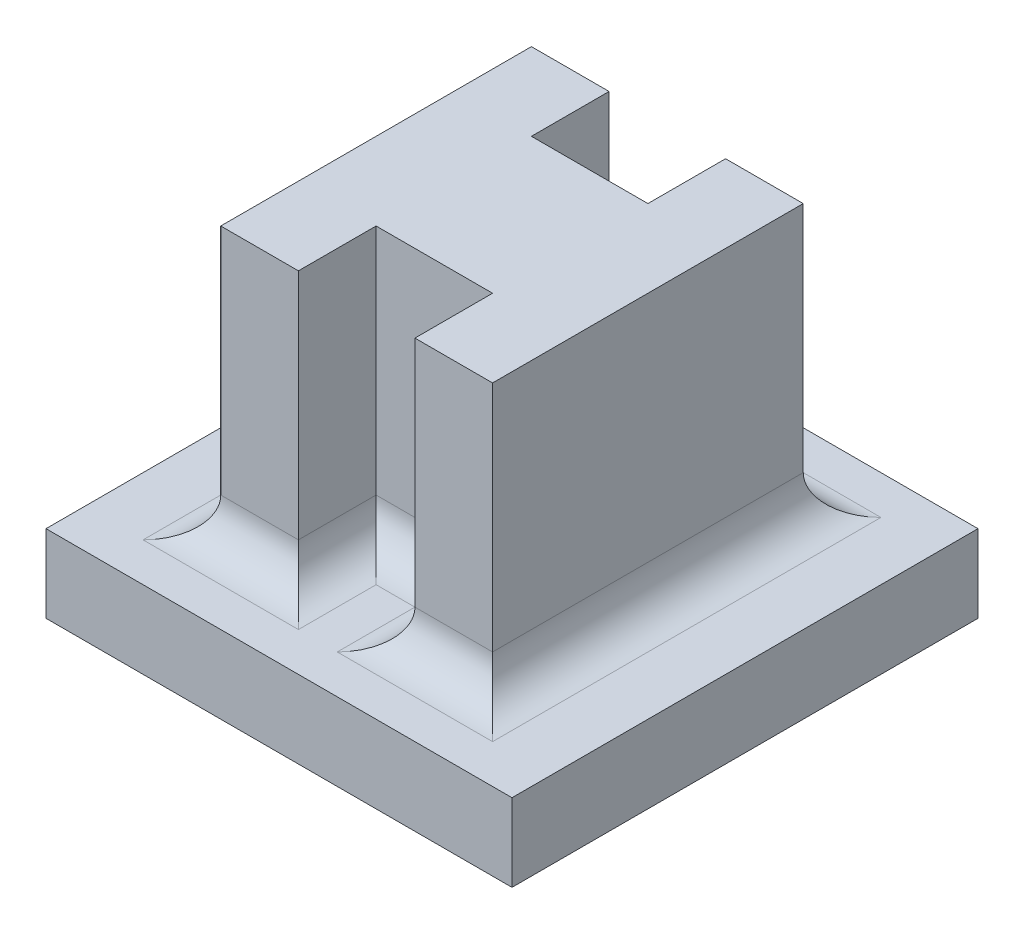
ISO-10303-21;
HEADER;
FILE_DESCRIPTION(('STEP AP214'),'2;1');
FILE_NAME('part.step','',(''),(''),'','','');
FILE_SCHEMA(('AUTOMOTIVE_DESIGN { 1 0 10303 214 1 1 1 1 }'));
ENDSEC;
DATA;
#1=APPLICATION_CONTEXT('core data for automotive mechanical design processes');
#2=APPLICATION_PROTOCOL_DEFINITION('international standard','automotive_design',2000,#1);
#3=PRODUCT_CONTEXT('',#1,'mechanical');
#4=PRODUCT('Part','Part','',(#3));
#5=PRODUCT_RELATED_PRODUCT_CATEGORY('part','',(#4));
#6=PRODUCT_DEFINITION_FORMATION('','',#4);
#7=PRODUCT_DEFINITION_CONTEXT('part definition',#1,'design');
#8=PRODUCT_DEFINITION('design','',#6,#7);
#9=PRODUCT_DEFINITION_SHAPE('','',#8);
#10=(LENGTH_UNIT() NAMED_UNIT(*) SI_UNIT(.MILLI.,.METRE.));
#11=(NAMED_UNIT(*) PLANE_ANGLE_UNIT() SI_UNIT($,.RADIAN.));
#12=(NAMED_UNIT(*) SI_UNIT($,.STERADIAN.) SOLID_ANGLE_UNIT());
#13=UNCERTAINTY_MEASURE_WITH_UNIT(LENGTH_MEASURE(1.E-05),#10,'distance_accuracy_value','');
#14=(GEOMETRIC_REPRESENTATION_CONTEXT(3) GLOBAL_UNCERTAINTY_ASSIGNED_CONTEXT((#13)) GLOBAL_UNIT_ASSIGNED_CONTEXT((#10,
#11,#12)) REPRESENTATION_CONTEXT('',''));
#15=CARTESIAN_POINT('',(0.,0.,0.));
#16=DIRECTION('',(0.,0.,1.));
#17=DIRECTION('',(1.,0.,0.));
#18=AXIS2_PLACEMENT_3D('',#15,#16,#17);
#19=CARTESIAN_POINT('',(-30.,10.,30.));
#20=DIRECTION('',(0.,1.,0.));
#21=DIRECTION('',(0.,0.,1.));
#22=AXIS2_PLACEMENT_3D('',#19,#20,#21);
#23=PLANE('',#22);
#24=DIRECTION('',(1.,0.,0.));
#25=VECTOR('',#24,1.);
#26=CARTESIAN_POINT('',(-30.,10.,24.9999999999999));
#27=LINE('',#26,#25);
#28=CARTESIAN_POINT('',(22.5,10.,25.));
#29=VERTEX_POINT('',#28);
#30=CARTESIAN_POINT('',(2.50000000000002,10.,25.));
#31=VERTEX_POINT('',#30);
#32=EDGE_CURVE('E259',#29,#31,#27,.F.);
#33=ORIENTED_EDGE('',*,*,#32,.T.);
#34=DIRECTION('',(0.,0.,1.));
#35=VECTOR('',#34,1.);
#36=CARTESIAN_POINT('',(2.50000000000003,10.,30.));
#37=LINE('',#36,#35);
#38=CARTESIAN_POINT('',(2.50000000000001,10.,15.));
#39=VERTEX_POINT('',#38);
#40=EDGE_CURVE('E261',#31,#39,#37,.F.);
#41=ORIENTED_EDGE('',*,*,#40,.T.);
#42=DIRECTION('',(1.,0.,0.));
#43=VECTOR('',#42,1.);
#44=CARTESIAN_POINT('',(-30.,10.,15.));
#45=LINE('',#44,#43);
#46=CARTESIAN_POINT('',(-2.49999999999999,10.,15.));
#47=VERTEX_POINT('',#46);
#48=EDGE_CURVE('E239',#39,#47,#45,.F.);
#49=ORIENTED_EDGE('',*,*,#48,.T.);
#50=DIRECTION('',(0.,0.,-1.));
#51=VECTOR('',#50,1.);
#52=CARTESIAN_POINT('',(-2.49999999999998,10.,30.));
#53=LINE('',#52,#51);
#54=CARTESIAN_POINT('',(-2.49999999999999,10.,25.));
#55=VERTEX_POINT('',#54);
#56=EDGE_CURVE('E241',#47,#55,#53,.F.);
#57=ORIENTED_EDGE('',*,*,#56,.T.);
#58=DIRECTION('',(1.,0.,0.));
#59=VECTOR('',#58,1.);
#60=CARTESIAN_POINT('',(-30.,10.,25.));
#61=LINE('',#60,#59);
#62=CARTESIAN_POINT('',(-22.5,10.,25.));
#63=VERTEX_POINT('',#62);
#64=EDGE_CURVE('E243',#55,#63,#61,.F.);
#65=ORIENTED_EDGE('',*,*,#64,.T.);
#66=DIRECTION('',(0.,0.,1.));
#67=VECTOR('',#66,1.);
#68=CARTESIAN_POINT('',(-22.5,10.,30.));
#69=LINE('',#68,#67);
#70=CARTESIAN_POINT('',(-22.5,10.,-25.));
#71=VERTEX_POINT('',#70);
#72=EDGE_CURVE('E245',#63,#71,#69,.F.);
#73=ORIENTED_EDGE('',*,*,#72,.T.);
#74=DIRECTION('',(-1.,0.,0.));
#75=VECTOR('',#74,1.);
#76=CARTESIAN_POINT('',(-30.,10.,-25.));
#77=LINE('',#76,#75);
#78=CARTESIAN_POINT('',(-2.49999999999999,10.,-25.));
#79=VERTEX_POINT('',#78);
#80=EDGE_CURVE('E247',#71,#79,#77,.F.);
#81=ORIENTED_EDGE('',*,*,#80,.T.);
#82=DIRECTION('',(0.,0.,-1.));
#83=VECTOR('',#82,1.);
#84=CARTESIAN_POINT('',(-2.5,10.,30.));
#85=LINE('',#84,#83);
#86=CARTESIAN_POINT('',(-2.49999999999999,10.,-15.));
#87=VERTEX_POINT('',#86);
#88=EDGE_CURVE('E249',#79,#87,#85,.F.);
#89=ORIENTED_EDGE('',*,*,#88,.T.);
#90=DIRECTION('',(-1.,0.,0.));
#91=VECTOR('',#90,1.);
#92=CARTESIAN_POINT('',(-30.,10.,-15.));
#93=LINE('',#92,#91);
#94=CARTESIAN_POINT('',(2.50000000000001,10.,-15.));
#95=VERTEX_POINT('',#94);
#96=EDGE_CURVE('E251',#87,#95,#93,.F.);
#97=ORIENTED_EDGE('',*,*,#96,.T.);
#98=DIRECTION('',(0.,0.,1.));
#99=VECTOR('',#98,1.);
#100=CARTESIAN_POINT('',(2.49999999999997,10.,30.));
#101=LINE('',#100,#99);
#102=CARTESIAN_POINT('',(2.50000000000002,10.,-25.));
#103=VERTEX_POINT('',#102);
#104=EDGE_CURVE('E253',#95,#103,#101,.F.);
#105=ORIENTED_EDGE('',*,*,#104,.T.);
#106=DIRECTION('',(-1.,0.,0.));
#107=VECTOR('',#106,1.);
#108=CARTESIAN_POINT('',(-30.,10.,-25.));
#109=LINE('',#108,#107);
#110=CARTESIAN_POINT('',(22.5,10.,-25.));
#111=VERTEX_POINT('',#110);
#112=EDGE_CURVE('E255',#103,#111,#109,.F.);
#113=ORIENTED_EDGE('',*,*,#112,.T.);
#114=DIRECTION('',(0.,0.,-1.));
#115=VECTOR('',#114,1.);
#116=CARTESIAN_POINT('',(22.5,10.,30.));
#117=LINE('',#116,#115);
#118=EDGE_CURVE('E257',#111,#29,#117,.F.);
#119=ORIENTED_EDGE('',*,*,#118,.T.);
#120=EDGE_LOOP('',(#33,#41,#49,#57,#65,#73,#81,#89,#97,#105,#113,#119));
#121=FACE_BOUND('',#120,.T.);
#122=DIRECTION('',(0.,0.,1.));
#123=VECTOR('',#122,1.);
#124=CARTESIAN_POINT('',(-30.,10.,-30.));
#125=LINE('',#124,#123);
#126=CARTESIAN_POINT('',(-30.,10.,-30.));
#127=VERTEX_POINT('',#126);
#128=CARTESIAN_POINT('',(-30.,10.,30.));
#129=VERTEX_POINT('',#128);
#130=EDGE_CURVE('E215',#127,#129,#125,.T.);
#131=ORIENTED_EDGE('',*,*,#130,.T.);
#132=DIRECTION('',(1.,0.,0.));
#133=VECTOR('',#132,1.);
#134=CARTESIAN_POINT('',(-30.,10.,30.));
#135=LINE('',#134,#133);
#136=CARTESIAN_POINT('',(30.,10.,30.));
#137=VERTEX_POINT('',#136);
#138=EDGE_CURVE('E218',#129,#137,#135,.T.);
#139=ORIENTED_EDGE('',*,*,#138,.T.);
#140=DIRECTION('',(0.,0.,-1.));
#141=VECTOR('',#140,1.);
#142=CARTESIAN_POINT('',(30.,10.,-30.));
#143=LINE('',#142,#141);
#144=CARTESIAN_POINT('',(30.,10.,-30.));
#145=VERTEX_POINT('',#144);
#146=EDGE_CURVE('E220',#137,#145,#143,.T.);
#147=ORIENTED_EDGE('',*,*,#146,.T.);
#148=DIRECTION('',(-1.,0.,0.));
#149=VECTOR('',#148,1.);
#150=CARTESIAN_POINT('',(-30.,10.,-30.));
#151=LINE('',#150,#149);
#152=EDGE_CURVE('E222',#145,#127,#151,.T.);
#153=ORIENTED_EDGE('',*,*,#152,.T.);
#154=EDGE_LOOP('',(#131,#139,#147,#153));
#155=FACE_BOUND('',#154,.T.);
#156=ADVANCED_FACE('F33',(#121,#155),#23,.T.);
#157=CARTESIAN_POINT('',(-30.,10.,-30.));
#158=DIRECTION('',(1.,0.,0.));
#159=DIRECTION('',(0.,0.,-1.));
#160=AXIS2_PLACEMENT_3D('',#157,#158,#159);
#161=PLANE('',#160);
#162=DIRECTION('',(0.,0.,1.));
#163=VECTOR('',#162,1.);
#164=CARTESIAN_POINT('',(-30.,0.,-30.));
#165=LINE('',#164,#163);
#166=CARTESIAN_POINT('',(-30.,0.,-30.));
#167=VERTEX_POINT('',#166);
#168=CARTESIAN_POINT('',(-30.,0.,30.));
#169=VERTEX_POINT('',#168);
#170=EDGE_CURVE('E201',#167,#169,#165,.T.);
#171=ORIENTED_EDGE('',*,*,#170,.T.);
#172=DIRECTION('',(0.,-1.,0.));
#173=VECTOR('',#172,1.);
#174=CARTESIAN_POINT('',(-30.,10.,30.));
#175=LINE('',#174,#173);
#176=EDGE_CURVE('E233',#129,#169,#175,.T.);
#177=ORIENTED_EDGE('',*,*,#176,.F.);
#178=ORIENTED_EDGE('',*,*,#130,.F.);
#179=DIRECTION('',(0.,-1.,0.));
#180=VECTOR('',#179,1.);
#181=CARTESIAN_POINT('',(-30.,10.,-30.));
#182=LINE('',#181,#180);
#183=EDGE_CURVE('E224',#127,#167,#182,.T.);
#184=ORIENTED_EDGE('',*,*,#183,.T.);
#185=EDGE_LOOP('',(#171,#177,#178,#184));
#186=FACE_BOUND('',#185,.T.);
#187=ADVANCED_FACE('F35',(#186),#161,.F.);
#188=CARTESIAN_POINT('',(-30.,10.,30.));
#189=DIRECTION('',(0.,0.,-1.));
#190=DIRECTION('',(-1.,0.,0.));
#191=AXIS2_PLACEMENT_3D('',#188,#189,#190);
#192=PLANE('',#191);
#193=DIRECTION('',(1.,0.,0.));
#194=VECTOR('',#193,1.);
#195=CARTESIAN_POINT('',(-30.,0.,30.));
#196=LINE('',#195,#194);
#197=CARTESIAN_POINT('',(30.,0.,30.));
#198=VERTEX_POINT('',#197);
#199=EDGE_CURVE('E204',#169,#198,#196,.T.);
#200=ORIENTED_EDGE('',*,*,#199,.T.);
#201=DIRECTION('',(0.,-1.,0.));
#202=VECTOR('',#201,1.);
#203=CARTESIAN_POINT('',(30.,10.,30.));
#204=LINE('',#203,#202);
#205=EDGE_CURVE('E230',#137,#198,#204,.T.);
#206=ORIENTED_EDGE('',*,*,#205,.F.);
#207=ORIENTED_EDGE('',*,*,#138,.F.);
#208=ORIENTED_EDGE('',*,*,#176,.T.);
#209=EDGE_LOOP('',(#200,#206,#207,#208));
#210=FACE_BOUND('',#209,.T.);
#211=ADVANCED_FACE('F462',(#210),#192,.F.);
#212=CARTESIAN_POINT('',(30.,10.,-30.));
#213=DIRECTION('',(-1.,0.,0.));
#214=DIRECTION('',(0.,0.,1.));
#215=AXIS2_PLACEMENT_3D('',#212,#213,#214);
#216=PLANE('',#215);
#217=DIRECTION('',(0.,0.,-1.));
#218=VECTOR('',#217,1.);
#219=CARTESIAN_POINT('',(30.,0.,-30.));
#220=LINE('',#219,#218);
#221=CARTESIAN_POINT('',(30.,0.,-30.));
#222=VERTEX_POINT('',#221);
#223=EDGE_CURVE('E211',#198,#222,#220,.T.);
#224=ORIENTED_EDGE('',*,*,#223,.T.);
#225=DIRECTION('',(0.,-1.,0.));
#226=VECTOR('',#225,1.);
#227=CARTESIAN_POINT('',(30.,10.,-30.));
#228=LINE('',#227,#226);
#229=EDGE_CURVE('E227',#145,#222,#228,.T.);
#230=ORIENTED_EDGE('',*,*,#229,.F.);
#231=ORIENTED_EDGE('',*,*,#146,.F.);
#232=ORIENTED_EDGE('',*,*,#205,.T.);
#233=EDGE_LOOP('',(#224,#230,#231,#232));
#234=FACE_BOUND('',#233,.T.);
#235=ADVANCED_FACE('F467',(#234),#216,.F.);
#236=CARTESIAN_POINT('',(-30.,10.,-30.));
#237=DIRECTION('',(0.,0.,1.));
#238=DIRECTION('',(1.,0.,0.));
#239=AXIS2_PLACEMENT_3D('',#236,#237,#238);
#240=PLANE('',#239);
#241=DIRECTION('',(-1.,0.,0.));
#242=VECTOR('',#241,1.);
#243=CARTESIAN_POINT('',(-30.,0.,-30.));
#244=LINE('',#243,#242);
#245=EDGE_CURVE('E213',#222,#167,#244,.T.);
#246=ORIENTED_EDGE('',*,*,#245,.T.);
#247=ORIENTED_EDGE('',*,*,#183,.F.);
#248=ORIENTED_EDGE('',*,*,#152,.F.);
#249=ORIENTED_EDGE('',*,*,#229,.T.);
#250=EDGE_LOOP('',(#246,#247,#248,#249));
#251=FACE_BOUND('',#250,.T.);
#252=ADVANCED_FACE('F470',(#251),#240,.F.);
#253=CARTESIAN_POINT('',(-30.,0.,30.));
#254=DIRECTION('',(0.,1.,0.));
#255=DIRECTION('',(0.,0.,1.));
#256=AXIS2_PLACEMENT_3D('',#253,#254,#255);
#257=PLANE('',#256);
#258=ORIENTED_EDGE('',*,*,#170,.F.);
#259=ORIENTED_EDGE('',*,*,#245,.F.);
#260=ORIENTED_EDGE('',*,*,#223,.F.);
#261=ORIENTED_EDGE('',*,*,#199,.F.);
#262=EDGE_LOOP('',(#258,#259,#260,#261));
#263=FACE_BOUND('',#262,.T.);
#264=ADVANCED_FACE('F472',(#263),#257,.F.);
#265=CARTESIAN_POINT('',(-7.49999999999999,45.,20.));
#266=DIRECTION('',(-1.,0.,0.));
#267=DIRECTION('',(0.,0.,1.));
#268=AXIS2_PLACEMENT_3D('',#265,#266,#267);
#269=PLANE('',#268);
#270=DIRECTION('',(0.,-1.,0.));
#271=VECTOR('',#270,1.);
#272=CARTESIAN_POINT('',(-7.49999999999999,45.,20.));
#273=LINE('',#272,#271);
#274=CARTESIAN_POINT('',(-7.49999999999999,45.,20.));
#275=VERTEX_POINT('',#274);
#276=CARTESIAN_POINT('',(-7.49999999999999,15.,20.));
#277=VERTEX_POINT('',#276);
#278=EDGE_CURVE('E294',#275,#277,#273,.T.);
#279=ORIENTED_EDGE('',*,*,#278,.T.);
#280=DIRECTION('',(0.,0.,-1.));
#281=VECTOR('',#280,1.);
#282=CARTESIAN_POINT('',(-7.49999999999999,15.,20.));
#283=LINE('',#282,#281);
#284=CARTESIAN_POINT('',(-7.49999999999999,15.,9.99999999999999));
#285=VERTEX_POINT('',#284);
#286=EDGE_CURVE('E41',#277,#285,#283,.T.);
#287=ORIENTED_EDGE('',*,*,#286,.T.);
#288=DIRECTION('',(0.,-1.,0.));
#289=VECTOR('',#288,1.);
#290=CARTESIAN_POINT('',(-7.49999999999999,45.,9.99999999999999));
#291=LINE('',#290,#289);
#292=CARTESIAN_POINT('',(-7.49999999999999,45.,9.99999999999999));
#293=VERTEX_POINT('',#292);
#294=EDGE_CURVE('E185',#293,#285,#291,.T.);
#295=ORIENTED_EDGE('',*,*,#294,.F.);
#296=DIRECTION('',(0.,0.,-1.));
#297=VECTOR('',#296,1.);
#298=CARTESIAN_POINT('',(-7.49999999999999,45.,20.));
#299=LINE('',#298,#297);
#300=EDGE_CURVE('E192',#275,#293,#299,.T.);
#301=ORIENTED_EDGE('',*,*,#300,.F.);
#302=EDGE_LOOP('',(#279,#287,#295,#301));
#303=FACE_BOUND('',#302,.T.);
#304=ADVANCED_FACE('F200',(#303),#269,.F.);
#305=CARTESIAN_POINT('',(-7.49999999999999,45.,9.99999999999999));
#306=DIRECTION('',(0.,0.,-1.));
#307=DIRECTION('',(-1.,0.,0.));
#308=AXIS2_PLACEMENT_3D('',#305,#306,#307);
#309=PLANE('',#308);
#310=ORIENTED_EDGE('',*,*,#294,.T.);
#311=DIRECTION('',(1.,0.,0.));
#312=VECTOR('',#311,1.);
#313=CARTESIAN_POINT('',(-7.49999999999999,15.,9.99999999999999));
#314=LINE('',#313,#312);
#315=CARTESIAN_POINT('',(7.50000000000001,15.,9.99999999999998));
#316=VERTEX_POINT('',#315);
#317=EDGE_CURVE('E11',#285,#316,#314,.T.);
#318=ORIENTED_EDGE('',*,*,#317,.T.);
#319=DIRECTION('',(0.,-1.,0.));
#320=VECTOR('',#319,1.);
#321=CARTESIAN_POINT('',(7.50000000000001,45.,9.99999999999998));
#322=LINE('',#321,#320);
#323=CARTESIAN_POINT('',(7.50000000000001,45.,9.99999999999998));
#324=VERTEX_POINT('',#323);
#325=EDGE_CURVE('E188',#324,#316,#322,.T.);
#326=ORIENTED_EDGE('',*,*,#325,.F.);
#327=DIRECTION('',(1.,0.,0.));
#328=VECTOR('',#327,1.);
#329=CARTESIAN_POINT('',(-7.49999999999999,45.,9.99999999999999));
#330=LINE('',#329,#328);
#331=EDGE_CURVE('E182',#293,#324,#330,.T.);
#332=ORIENTED_EDGE('',*,*,#331,.F.);
#333=EDGE_LOOP('',(#310,#318,#326,#332));
#334=FACE_BOUND('',#333,.T.);
#335=ADVANCED_FACE('F184',(#334),#309,.F.);
#336=CARTESIAN_POINT('',(7.50000000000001,45.,9.99999999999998));
#337=DIRECTION('',(1.,0.,0.));
#338=DIRECTION('',(0.,0.,-1.));
#339=AXIS2_PLACEMENT_3D('',#336,#337,#338);
#340=PLANE('',#339);
#341=ORIENTED_EDGE('',*,*,#325,.T.);
#342=DIRECTION('',(0.,0.,1.));
#343=VECTOR('',#342,1.);
#344=CARTESIAN_POINT('',(7.50000000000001,15.,9.99999999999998));
#345=LINE('',#344,#343);
#346=CARTESIAN_POINT('',(7.50000000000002,15.,20.));
#347=VERTEX_POINT('',#346);
#348=EDGE_CURVE('E236',#316,#347,#345,.T.);
#349=ORIENTED_EDGE('',*,*,#348,.T.);
#350=DIRECTION('',(0.,-1.,0.));
#351=VECTOR('',#350,1.);
#352=CARTESIAN_POINT('',(7.50000000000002,45.,20.));
#353=LINE('',#352,#351);
#354=CARTESIAN_POINT('',(7.50000000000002,45.,20.));
#355=VERTEX_POINT('',#354);
#356=EDGE_CURVE('E206',#355,#347,#353,.T.);
#357=ORIENTED_EDGE('',*,*,#356,.F.);
#358=DIRECTION('',(0.,0.,1.));
#359=VECTOR('',#358,1.);
#360=CARTESIAN_POINT('',(7.50000000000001,45.,9.99999999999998));
#361=LINE('',#360,#359);
#362=EDGE_CURVE('E191',#324,#355,#361,.T.);
#363=ORIENTED_EDGE('',*,*,#362,.F.);
#364=EDGE_LOOP('',(#341,#349,#357,#363));
#365=FACE_BOUND('',#364,.T.);
#366=ADVANCED_FACE('F326',(#365),#340,.F.);
#367=CARTESIAN_POINT('',(7.50000000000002,45.,20.));
#368=DIRECTION('',(0.,0.,-1.));
#369=DIRECTION('',(-1.,0.,0.));
#370=AXIS2_PLACEMENT_3D('',#367,#368,#369);
#371=PLANE('',#370);
#372=ORIENTED_EDGE('',*,*,#356,.T.);
#373=DIRECTION('',(1.,0.,0.));
#374=VECTOR('',#373,1.);
#375=CARTESIAN_POINT('',(7.50000000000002,15.,20.));
#376=LINE('',#375,#374);
#377=CARTESIAN_POINT('',(17.5,15.,20.));
#378=VERTEX_POINT('',#377);
#379=EDGE_CURVE('E264',#347,#378,#376,.T.);
#380=ORIENTED_EDGE('',*,*,#379,.T.);
#381=DIRECTION('',(0.,-1.,0.));
#382=VECTOR('',#381,1.);
#383=CARTESIAN_POINT('',(17.5,45.,20.));
#384=LINE('',#383,#382);
#385=CARTESIAN_POINT('',(17.5,45.,20.));
#386=VERTEX_POINT('',#385);
#387=EDGE_CURVE('E366',#386,#378,#384,.T.);
#388=ORIENTED_EDGE('',*,*,#387,.F.);
#389=DIRECTION('',(1.,0.,0.));
#390=VECTOR('',#389,1.);
#391=CARTESIAN_POINT('',(7.50000000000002,45.,20.));
#392=LINE('',#391,#390);
#393=EDGE_CURVE('E330',#355,#386,#392,.T.);
#394=ORIENTED_EDGE('',*,*,#393,.F.);
#395=EDGE_LOOP('',(#372,#380,#388,#394));
#396=FACE_BOUND('',#395,.T.);
#397=ADVANCED_FACE('F369',(#396),#371,.F.);
#398=CARTESIAN_POINT('',(17.5,45.,-20.));
#399=DIRECTION('',(-1.,0.,0.));
#400=DIRECTION('',(0.,0.,1.));
#401=AXIS2_PLACEMENT_3D('',#398,#399,#400);
#402=PLANE('',#401);
#403=ORIENTED_EDGE('',*,*,#387,.T.);
#404=DIRECTION('',(0.,0.,-1.));
#405=VECTOR('',#404,1.);
#406=CARTESIAN_POINT('',(17.5,15.,-20.));
#407=LINE('',#406,#405);
#408=CARTESIAN_POINT('',(17.5,15.,-20.));
#409=VERTEX_POINT('',#408);
#410=EDGE_CURVE('E266',#378,#409,#407,.T.);
#411=ORIENTED_EDGE('',*,*,#410,.T.);
#412=DIRECTION('',(0.,-1.,0.));
#413=VECTOR('',#412,1.);
#414=CARTESIAN_POINT('',(17.5,45.,-20.));
#415=LINE('',#414,#413);
#416=CARTESIAN_POINT('',(17.5,45.,-20.));
#417=VERTEX_POINT('',#416);
#418=EDGE_CURVE('E363',#417,#409,#415,.T.);
#419=ORIENTED_EDGE('',*,*,#418,.F.);
#420=DIRECTION('',(0.,0.,-1.));
#421=VECTOR('',#420,1.);
#422=CARTESIAN_POINT('',(17.5,45.,-20.));
#423=LINE('',#422,#421);
#424=EDGE_CURVE('E332',#386,#417,#423,.T.);
#425=ORIENTED_EDGE('',*,*,#424,.F.);
#426=EDGE_LOOP('',(#403,#411,#419,#425));
#427=FACE_BOUND('',#426,.T.);
#428=ADVANCED_FACE('F377',(#427),#402,.F.);
#429=CARTESIAN_POINT('',(7.50000000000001,45.,-20.));
#430=DIRECTION('',(0.,0.,1.));
#431=DIRECTION('',(1.,0.,0.));
#432=AXIS2_PLACEMENT_3D('',#429,#430,#431);
#433=PLANE('',#432);
#434=ORIENTED_EDGE('',*,*,#418,.T.);
#435=DIRECTION('',(-1.,0.,0.));
#436=VECTOR('',#435,1.);
#437=CARTESIAN_POINT('',(7.50000000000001,15.,-20.));
#438=LINE('',#437,#436);
#439=CARTESIAN_POINT('',(7.50000000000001,15.,-20.));
#440=VERTEX_POINT('',#439);
#441=EDGE_CURVE('E268',#409,#440,#438,.T.);
#442=ORIENTED_EDGE('',*,*,#441,.T.);
#443=DIRECTION('',(0.,-1.,0.));
#444=VECTOR('',#443,1.);
#445=CARTESIAN_POINT('',(7.50000000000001,45.,-20.));
#446=LINE('',#445,#444);
#447=CARTESIAN_POINT('',(7.50000000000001,45.,-20.));
#448=VERTEX_POINT('',#447);
#449=EDGE_CURVE('E360',#448,#440,#446,.T.);
#450=ORIENTED_EDGE('',*,*,#449,.F.);
#451=DIRECTION('',(-1.,0.,0.));
#452=VECTOR('',#451,1.);
#453=CARTESIAN_POINT('',(7.50000000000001,45.,-20.));
#454=LINE('',#453,#452);
#455=EDGE_CURVE('E336',#417,#448,#454,.T.);
#456=ORIENTED_EDGE('',*,*,#455,.F.);
#457=EDGE_LOOP('',(#434,#442,#450,#456));
#458=FACE_BOUND('',#457,.T.);
#459=ADVANCED_FACE('F381',(#458),#433,.F.);
#460=CARTESIAN_POINT('',(7.50000000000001,45.,-10.));
#461=DIRECTION('',(1.,0.,0.));
#462=DIRECTION('',(0.,0.,-1.));
#463=AXIS2_PLACEMENT_3D('',#460,#461,#462);
#464=PLANE('',#463);
#465=ORIENTED_EDGE('',*,*,#449,.T.);
#466=DIRECTION('',(0.,0.,1.));
#467=VECTOR('',#466,1.);
#468=CARTESIAN_POINT('',(7.50000000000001,15.,-10.));
#469=LINE('',#468,#467);
#470=CARTESIAN_POINT('',(7.50000000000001,15.,-10.));
#471=VERTEX_POINT('',#470);
#472=EDGE_CURVE('E270',#440,#471,#469,.T.);
#473=ORIENTED_EDGE('',*,*,#472,.T.);
#474=DIRECTION('',(0.,-1.,0.));
#475=VECTOR('',#474,1.);
#476=CARTESIAN_POINT('',(7.50000000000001,45.,-10.));
#477=LINE('',#476,#475);
#478=CARTESIAN_POINT('',(7.50000000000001,45.,-10.));
#479=VERTEX_POINT('',#478);
#480=EDGE_CURVE('E357',#479,#471,#477,.T.);
#481=ORIENTED_EDGE('',*,*,#480,.F.);
#482=DIRECTION('',(0.,0.,1.));
#483=VECTOR('',#482,1.);
#484=CARTESIAN_POINT('',(7.50000000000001,45.,-10.));
#485=LINE('',#484,#483);
#486=EDGE_CURVE('E338',#448,#479,#485,.T.);
#487=ORIENTED_EDGE('',*,*,#486,.F.);
#488=EDGE_LOOP('',(#465,#473,#481,#487));
#489=FACE_BOUND('',#488,.T.);
#490=ADVANCED_FACE('F386',(#489),#464,.F.);
#491=CARTESIAN_POINT('',(-7.49999999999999,45.,-10.));
#492=DIRECTION('',(0.,0.,1.));
#493=DIRECTION('',(1.,0.,0.));
#494=AXIS2_PLACEMENT_3D('',#491,#492,#493);
#495=PLANE('',#494);
#496=ORIENTED_EDGE('',*,*,#480,.T.);
#497=DIRECTION('',(-1.,0.,0.));
#498=VECTOR('',#497,1.);
#499=CARTESIAN_POINT('',(-7.49999999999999,15.,-10.));
#500=LINE('',#499,#498);
#501=CARTESIAN_POINT('',(-7.49999999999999,15.,-10.));
#502=VERTEX_POINT('',#501);
#503=EDGE_CURVE('E272',#471,#502,#500,.T.);
#504=ORIENTED_EDGE('',*,*,#503,.T.);
#505=DIRECTION('',(0.,-1.,0.));
#506=VECTOR('',#505,1.);
#507=CARTESIAN_POINT('',(-7.49999999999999,45.,-10.));
#508=LINE('',#507,#506);
#509=CARTESIAN_POINT('',(-7.49999999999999,45.,-10.));
#510=VERTEX_POINT('',#509);
#511=EDGE_CURVE('E354',#510,#502,#508,.T.);
#512=ORIENTED_EDGE('',*,*,#511,.F.);
#513=DIRECTION('',(-1.,0.,0.));
#514=VECTOR('',#513,1.);
#515=CARTESIAN_POINT('',(-7.49999999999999,45.,-10.));
#516=LINE('',#515,#514);
#517=EDGE_CURVE('E340',#479,#510,#516,.T.);
#518=ORIENTED_EDGE('',*,*,#517,.F.);
#519=EDGE_LOOP('',(#496,#504,#512,#518));
#520=FACE_BOUND('',#519,.T.);
#521=ADVANCED_FACE('F392',(#520),#495,.F.);
#522=CARTESIAN_POINT('',(-7.49999999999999,45.,-20.));
#523=DIRECTION('',(-1.,0.,0.));
#524=DIRECTION('',(0.,0.,1.));
#525=AXIS2_PLACEMENT_3D('',#522,#523,#524);
#526=PLANE('',#525);
#527=ORIENTED_EDGE('',*,*,#511,.T.);
#528=DIRECTION('',(0.,0.,-1.));
#529=VECTOR('',#528,1.);
#530=CARTESIAN_POINT('',(-7.49999999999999,15.,-20.));
#531=LINE('',#530,#529);
#532=CARTESIAN_POINT('',(-7.49999999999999,15.,-20.));
#533=VERTEX_POINT('',#532);
#534=EDGE_CURVE('E274',#502,#533,#531,.T.);
#535=ORIENTED_EDGE('',*,*,#534,.T.);
#536=DIRECTION('',(0.,-1.,0.));
#537=VECTOR('',#536,1.);
#538=CARTESIAN_POINT('',(-7.49999999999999,45.,-20.));
#539=LINE('',#538,#537);
#540=CARTESIAN_POINT('',(-7.49999999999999,45.,-20.));
#541=VERTEX_POINT('',#540);
#542=EDGE_CURVE('E351',#541,#533,#539,.T.);
#543=ORIENTED_EDGE('',*,*,#542,.F.);
#544=DIRECTION('',(0.,0.,-1.));
#545=VECTOR('',#544,1.);
#546=CARTESIAN_POINT('',(-7.49999999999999,45.,-20.));
#547=LINE('',#546,#545);
#548=EDGE_CURVE('E342',#510,#541,#547,.T.);
#549=ORIENTED_EDGE('',*,*,#548,.F.);
#550=EDGE_LOOP('',(#527,#535,#543,#549));
#551=FACE_BOUND('',#550,.T.);
#552=ADVANCED_FACE('F396',(#551),#526,.F.);
#553=CARTESIAN_POINT('',(-17.5,45.,-20.));
#554=DIRECTION('',(0.,0.,1.));
#555=DIRECTION('',(1.,0.,0.));
#556=AXIS2_PLACEMENT_3D('',#553,#554,#555);
#557=PLANE('',#556);
#558=ORIENTED_EDGE('',*,*,#542,.T.);
#559=DIRECTION('',(-1.,0.,0.));
#560=VECTOR('',#559,1.);
#561=CARTESIAN_POINT('',(-17.5,15.,-20.));
#562=LINE('',#561,#560);
#563=CARTESIAN_POINT('',(-17.5,15.,-20.));
#564=VERTEX_POINT('',#563);
#565=EDGE_CURVE('E276',#533,#564,#562,.T.);
#566=ORIENTED_EDGE('',*,*,#565,.T.);
#567=DIRECTION('',(0.,-1.,0.));
#568=VECTOR('',#567,1.);
#569=CARTESIAN_POINT('',(-17.5,45.,-20.));
#570=LINE('',#569,#568);
#571=CARTESIAN_POINT('',(-17.5,45.,-20.));
#572=VERTEX_POINT('',#571);
#573=EDGE_CURVE('E288',#572,#564,#570,.T.);
#574=ORIENTED_EDGE('',*,*,#573,.F.);
#575=DIRECTION('',(-1.,0.,0.));
#576=VECTOR('',#575,1.);
#577=CARTESIAN_POINT('',(-17.5,45.,-20.));
#578=LINE('',#577,#576);
#579=EDGE_CURVE('E344',#541,#572,#578,.T.);
#580=ORIENTED_EDGE('',*,*,#579,.F.);
#581=EDGE_LOOP('',(#558,#566,#574,#580));
#582=FACE_BOUND('',#581,.T.);
#583=ADVANCED_FACE('F400',(#582),#557,.F.);
#584=CARTESIAN_POINT('',(-17.5,45.,20.));
#585=DIRECTION('',(1.,0.,0.));
#586=DIRECTION('',(0.,0.,-1.));
#587=AXIS2_PLACEMENT_3D('',#584,#585,#586);
#588=PLANE('',#587);
#589=ORIENTED_EDGE('',*,*,#573,.T.);
#590=DIRECTION('',(0.,0.,1.));
#591=VECTOR('',#590,1.);
#592=CARTESIAN_POINT('',(-17.5,15.,20.));
#593=LINE('',#592,#591);
#594=CARTESIAN_POINT('',(-17.5,15.,20.));
#595=VERTEX_POINT('',#594);
#596=EDGE_CURVE('E278',#564,#595,#593,.T.);
#597=ORIENTED_EDGE('',*,*,#596,.T.);
#598=DIRECTION('',(0.,-1.,0.));
#599=VECTOR('',#598,1.);
#600=CARTESIAN_POINT('',(-17.5,45.,20.));
#601=LINE('',#600,#599);
#602=CARTESIAN_POINT('',(-17.5,45.,20.));
#603=VERTEX_POINT('',#602);
#604=EDGE_CURVE('E286',#603,#595,#601,.T.);
#605=ORIENTED_EDGE('',*,*,#604,.F.);
#606=DIRECTION('',(0.,0.,1.));
#607=VECTOR('',#606,1.);
#608=CARTESIAN_POINT('',(-17.5,45.,20.));
#609=LINE('',#608,#607);
#610=EDGE_CURVE('E346',#572,#603,#609,.T.);
#611=ORIENTED_EDGE('',*,*,#610,.F.);
#612=EDGE_LOOP('',(#589,#597,#605,#611));
#613=FACE_BOUND('',#612,.T.);
#614=ADVANCED_FACE('F284',(#613),#588,.F.);
#615=CARTESIAN_POINT('',(-17.5,45.,20.));
#616=DIRECTION('',(0.,0.,-1.));
#617=DIRECTION('',(-1.,0.,0.));
#618=AXIS2_PLACEMENT_3D('',#615,#616,#617);
#619=PLANE('',#618);
#620=ORIENTED_EDGE('',*,*,#604,.T.);
#621=DIRECTION('',(1.,0.,0.));
#622=VECTOR('',#621,1.);
#623=CARTESIAN_POINT('',(-17.5,15.,20.));
#624=LINE('',#623,#622);
#625=EDGE_CURVE('E55',#595,#277,#624,.T.);
#626=ORIENTED_EDGE('',*,*,#625,.T.);
#627=ORIENTED_EDGE('',*,*,#278,.F.);
#628=DIRECTION('',(1.,0.,0.));
#629=VECTOR('',#628,1.);
#630=CARTESIAN_POINT('',(-17.5,45.,20.));
#631=LINE('',#630,#629);
#632=EDGE_CURVE('E197',#603,#275,#631,.T.);
#633=ORIENTED_EDGE('',*,*,#632,.F.);
#634=EDGE_LOOP('',(#620,#626,#627,#633));
#635=FACE_BOUND('',#634,.T.);
#636=ADVANCED_FACE('F293',(#635),#619,.F.);
#637=CARTESIAN_POINT('',(-7.49999999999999,45.,9.99999999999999));
#638=DIRECTION('',(0.,-1.,0.));
#639=DIRECTION('',(0.,0.,-1.));
#640=AXIS2_PLACEMENT_3D('',#637,#638,#639);
#641=PLANE('',#640);
#642=ORIENTED_EDGE('',*,*,#300,.T.);
#643=ORIENTED_EDGE('',*,*,#331,.T.);
#644=ORIENTED_EDGE('',*,*,#362,.T.);
#645=ORIENTED_EDGE('',*,*,#393,.T.);
#646=ORIENTED_EDGE('',*,*,#424,.T.);
#647=ORIENTED_EDGE('',*,*,#455,.T.);
#648=ORIENTED_EDGE('',*,*,#486,.T.);
#649=ORIENTED_EDGE('',*,*,#517,.T.);
#650=ORIENTED_EDGE('',*,*,#548,.T.);
#651=ORIENTED_EDGE('',*,*,#579,.T.);
#652=ORIENTED_EDGE('',*,*,#610,.T.);
#653=ORIENTED_EDGE('',*,*,#632,.T.);
#654=EDGE_LOOP('',(#642,#643,#644,#645,#646,#647,#648,#649,#650,#651,#652,#653));
#655=FACE_BOUND('',#654,.T.);
#656=ADVANCED_FACE('F195',(#655),#641,.F.);
#657=CARTESIAN_POINT('',(-2.49999999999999,15.,-20.));
#658=DIRECTION('',(0.,0.,-1.));
#659=DIRECTION('',(-1.,0.,0.));
#660=AXIS2_PLACEMENT_3D('',#657,#658,#659);
#661=CYLINDRICAL_SURFACE('',#660,5.);
#662=CARTESIAN_POINT('',(-2.49999999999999,15.,-15.));
#663=DIRECTION('',(-0.707106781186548,0.,-0.707106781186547));
#664=DIRECTION('',(-0.707106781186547,0.,0.707106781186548));
#665=AXIS2_PLACEMENT_3D('',#662,#663,#664);
#666=ELLIPSE('',#665,7.07106781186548,5.);
#667=EDGE_CURVE('E407',#87,#502,#666,.T.);
#668=ORIENTED_EDGE('',*,*,#667,.F.);
#669=ORIENTED_EDGE('',*,*,#88,.F.);
#670=CARTESIAN_POINT('',(-2.49999999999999,15.,-25.));
#671=DIRECTION('',(-0.707106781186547,0.,-0.707106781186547));
#672=DIRECTION('',(-0.707106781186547,0.,0.707106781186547));
#673=AXIS2_PLACEMENT_3D('',#670,#671,#672);
#674=ELLIPSE('',#673,7.07106781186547,5.);
#675=EDGE_CURVE('E198',#533,#79,#674,.F.);
#676=ORIENTED_EDGE('',*,*,#675,.F.);
#677=ORIENTED_EDGE('',*,*,#534,.F.);
#678=EDGE_LOOP('',(#668,#669,#676,#677));
#679=FACE_BOUND('',#678,.T.);
#680=ADVANCED_FACE('F449',(#679),#661,.F.);
#681=CARTESIAN_POINT('',(-17.5,15.,-25.));
#682=DIRECTION('',(-1.,0.,0.));
#683=DIRECTION('',(0.,0.,1.));
#684=AXIS2_PLACEMENT_3D('',#681,#682,#683);
#685=CYLINDRICAL_SURFACE('',#684,5.);
#686=ORIENTED_EDGE('',*,*,#675,.T.);
#687=ORIENTED_EDGE('',*,*,#80,.F.);
#688=CARTESIAN_POINT('',(-22.5,15.,-25.));
#689=DIRECTION('',(-0.707106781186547,0.,0.707106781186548));
#690=DIRECTION('',(0.707106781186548,0.,0.707106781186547));
#691=AXIS2_PLACEMENT_3D('',#688,#689,#690);
#692=ELLIPSE('',#691,7.07106781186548,5.);
#693=EDGE_CURVE('E406',#564,#71,#692,.F.);
#694=ORIENTED_EDGE('',*,*,#693,.F.);
#695=ORIENTED_EDGE('',*,*,#565,.F.);
#696=EDGE_LOOP('',(#686,#687,#694,#695));
#697=FACE_BOUND('',#696,.T.);
#698=ADVANCED_FACE('F404',(#697),#685,.F.);
#699=CARTESIAN_POINT('',(-7.49999999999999,15.,-15.));
#700=DIRECTION('',(-1.,0.,0.));
#701=DIRECTION('',(0.,0.,1.));
#702=AXIS2_PLACEMENT_3D('',#699,#700,#701);
#703=CYLINDRICAL_SURFACE('',#702,5.);
#704=ORIENTED_EDGE('',*,*,#667,.T.);
#705=ORIENTED_EDGE('',*,*,#503,.F.);
#706=CARTESIAN_POINT('',(2.50000000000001,15.,-15.));
#707=DIRECTION('',(-0.707106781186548,0.,0.707106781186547));
#708=DIRECTION('',(0.707106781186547,0.,0.707106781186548));
#709=AXIS2_PLACEMENT_3D('',#706,#707,#708);
#710=ELLIPSE('',#709,7.07106781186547,5.);
#711=EDGE_CURVE('E302',#95,#471,#710,.T.);
#712=ORIENTED_EDGE('',*,*,#711,.F.);
#713=ORIENTED_EDGE('',*,*,#96,.F.);
#714=EDGE_LOOP('',(#704,#705,#712,#713));
#715=FACE_BOUND('',#714,.T.);
#716=ADVANCED_FACE('F444',(#715),#703,.F.);
#717=CARTESIAN_POINT('',(-22.5,15.,20.));
#718=DIRECTION('',(0.,0.,1.));
#719=DIRECTION('',(1.,0.,0.));
#720=AXIS2_PLACEMENT_3D('',#717,#718,#719);
#721=CYLINDRICAL_SURFACE('',#720,5.);
#722=ORIENTED_EDGE('',*,*,#693,.T.);
#723=ORIENTED_EDGE('',*,*,#72,.F.);
#724=CARTESIAN_POINT('',(-22.5,15.,25.));
#725=DIRECTION('',(0.707106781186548,0.,0.707106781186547));
#726=DIRECTION('',(0.707106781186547,0.,-0.707106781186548));
#727=AXIS2_PLACEMENT_3D('',#724,#725,#726);
#728=ELLIPSE('',#727,7.07106781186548,5.);
#729=EDGE_CURVE('E298',#595,#63,#728,.F.);
#730=ORIENTED_EDGE('',*,*,#729,.F.);
#731=ORIENTED_EDGE('',*,*,#596,.F.);
#732=EDGE_LOOP('',(#722,#723,#730,#731));
#733=FACE_BOUND('',#732,.T.);
#734=ADVANCED_FACE('F299',(#733),#721,.F.);
#735=CARTESIAN_POINT('',(2.5,15.,-10.));
#736=DIRECTION('',(0.,0.,1.));
#737=DIRECTION('',(1.,0.,0.));
#738=AXIS2_PLACEMENT_3D('',#735,#736,#737);
#739=CYLINDRICAL_SURFACE('',#738,5.);
#740=ORIENTED_EDGE('',*,*,#711,.T.);
#741=ORIENTED_EDGE('',*,*,#472,.F.);
#742=CARTESIAN_POINT('',(2.50000000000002,15.,-25.));
#743=DIRECTION('',(-0.707106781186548,0.,0.707106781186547));
#744=DIRECTION('',(0.707106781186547,0.,0.707106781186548));
#745=AXIS2_PLACEMENT_3D('',#742,#743,#744);
#746=ELLIPSE('',#745,7.07106781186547,5.);
#747=EDGE_CURVE('E303',#103,#440,#746,.T.);
#748=ORIENTED_EDGE('',*,*,#747,.F.);
#749=ORIENTED_EDGE('',*,*,#104,.F.);
#750=EDGE_LOOP('',(#740,#741,#748,#749));
#751=FACE_BOUND('',#750,.T.);
#752=ADVANCED_FACE('F441',(#751),#739,.F.);
#753=CARTESIAN_POINT('',(-17.5,15.,25.));
#754=DIRECTION('',(1.,0.,0.));
#755=DIRECTION('',(0.,0.,-1.));
#756=AXIS2_PLACEMENT_3D('',#753,#754,#755);
#757=CYLINDRICAL_SURFACE('',#756,5.);
#758=ORIENTED_EDGE('',*,*,#729,.T.);
#759=ORIENTED_EDGE('',*,*,#64,.F.);
#760=CARTESIAN_POINT('',(-2.49999999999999,15.,25.));
#761=DIRECTION('',(0.707106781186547,0.,-0.707106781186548));
#762=DIRECTION('',(-0.707106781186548,0.,-0.707106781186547));
#763=AXIS2_PLACEMENT_3D('',#760,#761,#762);
#764=ELLIPSE('',#763,7.07106781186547,5.);
#765=EDGE_CURVE('E308',#277,#55,#764,.F.);
#766=ORIENTED_EDGE('',*,*,#765,.F.);
#767=ORIENTED_EDGE('',*,*,#625,.F.);
#768=EDGE_LOOP('',(#758,#759,#766,#767));
#769=FACE_BOUND('',#768,.T.);
#770=ADVANCED_FACE('F306',(#769),#757,.F.);
#771=CARTESIAN_POINT('',(7.50000000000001,15.,-25.));
#772=DIRECTION('',(-1.,0.,0.));
#773=DIRECTION('',(0.,0.,1.));
#774=AXIS2_PLACEMENT_3D('',#771,#772,#773);
#775=CYLINDRICAL_SURFACE('',#774,5.);
#776=ORIENTED_EDGE('',*,*,#747,.T.);
#777=ORIENTED_EDGE('',*,*,#441,.F.);
#778=CARTESIAN_POINT('',(22.5,15.,-25.));
#779=DIRECTION('',(-0.707106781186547,0.,-0.707106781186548));
#780=DIRECTION('',(-0.707106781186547,0.,0.707106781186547));
#781=AXIS2_PLACEMENT_3D('',#778,#779,#780);
#782=ELLIPSE('',#781,7.07106781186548,5.);
#783=EDGE_CURVE('E311',#111,#409,#782,.T.);
#784=ORIENTED_EDGE('',*,*,#783,.F.);
#785=ORIENTED_EDGE('',*,*,#112,.F.);
#786=EDGE_LOOP('',(#776,#777,#784,#785));
#787=FACE_BOUND('',#786,.T.);
#788=ADVANCED_FACE('F437',(#787),#775,.F.);
#789=CARTESIAN_POINT('',(-2.49999999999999,15.,20.));
#790=DIRECTION('',(0.,0.,-1.));
#791=DIRECTION('',(-1.,0.,0.));
#792=AXIS2_PLACEMENT_3D('',#789,#790,#791);
#793=CYLINDRICAL_SURFACE('',#792,5.);
#794=ORIENTED_EDGE('',*,*,#765,.T.);
#795=ORIENTED_EDGE('',*,*,#56,.F.);
#796=CARTESIAN_POINT('',(-2.49999999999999,15.,15.));
#797=DIRECTION('',(0.707106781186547,0.,-0.707106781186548));
#798=DIRECTION('',(-0.707106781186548,0.,-0.707106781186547));
#799=AXIS2_PLACEMENT_3D('',#796,#797,#798);
#800=ELLIPSE('',#799,7.07106781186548,5.);
#801=EDGE_CURVE('E315',#285,#47,#800,.F.);
#802=ORIENTED_EDGE('',*,*,#801,.F.);
#803=ORIENTED_EDGE('',*,*,#286,.F.);
#804=EDGE_LOOP('',(#794,#795,#802,#803));
#805=FACE_BOUND('',#804,.T.);
#806=ADVANCED_FACE('F313',(#805),#793,.F.);
#807=CARTESIAN_POINT('',(22.5,15.,-20.));
#808=DIRECTION('',(0.,0.,-1.));
#809=DIRECTION('',(-1.,0.,0.));
#810=AXIS2_PLACEMENT_3D('',#807,#808,#809);
#811=CYLINDRICAL_SURFACE('',#810,5.);
#812=ORIENTED_EDGE('',*,*,#783,.T.);
#813=ORIENTED_EDGE('',*,*,#410,.F.);
#814=CARTESIAN_POINT('',(22.5,15.,25.));
#815=DIRECTION('',(0.707106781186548,0.,-0.707106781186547));
#816=DIRECTION('',(-0.707106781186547,0.,-0.707106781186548));
#817=AXIS2_PLACEMENT_3D('',#814,#815,#816);
#818=ELLIPSE('',#817,7.07106781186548,5.);
#819=EDGE_CURVE('E319',#29,#378,#818,.T.);
#820=ORIENTED_EDGE('',*,*,#819,.F.);
#821=ORIENTED_EDGE('',*,*,#118,.F.);
#822=EDGE_LOOP('',(#812,#813,#820,#821));
#823=FACE_BOUND('',#822,.T.);
#824=ADVANCED_FACE('F433',(#823),#811,.F.);
#825=CARTESIAN_POINT('',(-7.49999999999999,15.,15.));
#826=DIRECTION('',(1.,0.,0.));
#827=DIRECTION('',(0.,0.,-1.));
#828=AXIS2_PLACEMENT_3D('',#825,#826,#827);
#829=CYLINDRICAL_SURFACE('',#828,5.);
#830=ORIENTED_EDGE('',*,*,#801,.T.);
#831=ORIENTED_EDGE('',*,*,#48,.F.);
#832=CARTESIAN_POINT('',(2.50000000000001,15.,15.));
#833=DIRECTION('',(0.707106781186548,0.,0.707106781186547));
#834=DIRECTION('',(-0.707106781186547,0.,0.707106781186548));
#835=AXIS2_PLACEMENT_3D('',#832,#833,#834);
#836=ELLIPSE('',#835,7.07106781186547,5.);
#837=EDGE_CURVE('E323',#316,#39,#836,.F.);
#838=ORIENTED_EDGE('',*,*,#837,.F.);
#839=ORIENTED_EDGE('',*,*,#317,.F.);
#840=EDGE_LOOP('',(#830,#831,#838,#839));
#841=FACE_BOUND('',#840,.T.);
#842=ADVANCED_FACE('F322',(#841),#829,.F.);
#843=CARTESIAN_POINT('',(7.50000000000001,15.,25.));
#844=DIRECTION('',(1.,0.,0.));
#845=DIRECTION('',(0.,0.,-1.));
#846=AXIS2_PLACEMENT_3D('',#843,#844,#845);
#847=CYLINDRICAL_SURFACE('',#846,5.);
#848=ORIENTED_EDGE('',*,*,#819,.T.);
#849=ORIENTED_EDGE('',*,*,#379,.F.);
#850=CARTESIAN_POINT('',(2.50000000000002,15.,25.));
#851=DIRECTION('',(0.707106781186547,0.,0.707106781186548));
#852=DIRECTION('',(0.707106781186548,0.,-0.707106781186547));
#853=AXIS2_PLACEMENT_3D('',#850,#851,#852);
#854=ELLIPSE('',#853,7.07106781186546,5.);
#855=EDGE_CURVE('E422',#31,#347,#854,.T.);
#856=ORIENTED_EDGE('',*,*,#855,.F.);
#857=ORIENTED_EDGE('',*,*,#32,.F.);
#858=EDGE_LOOP('',(#848,#849,#856,#857));
#859=FACE_BOUND('',#858,.T.);
#860=ADVANCED_FACE('F429',(#859),#847,.F.);
#861=CARTESIAN_POINT('',(2.50000000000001,15.,9.99999999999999));
#862=DIRECTION('',(0.,0.,1.));
#863=DIRECTION('',(1.,0.,0.));
#864=AXIS2_PLACEMENT_3D('',#861,#862,#863);
#865=CYLINDRICAL_SURFACE('',#864,5.);
#866=ORIENTED_EDGE('',*,*,#837,.T.);
#867=ORIENTED_EDGE('',*,*,#40,.F.);
#868=ORIENTED_EDGE('',*,*,#855,.T.);
#869=ORIENTED_EDGE('',*,*,#348,.F.);
#870=EDGE_LOOP('',(#866,#867,#868,#869));
#871=FACE_BOUND('',#870,.T.);
#872=ADVANCED_FACE('F426',(#871),#865,.F.);
#873=CLOSED_SHELL('',(#156,#187,#211,#235,#252,#264,#304,#335,#366,#397,#428,#459,#490,#521,
#552,#583,#614,#636,#656,#680,#698,#716,#734,#752,#770,#788,#806,#824,#842,#860,#872));
#874=MANIFOLD_SOLID_BREP('B2',#873);
#875=ADVANCED_BREP_SHAPE_REPRESENTATION('',(#18,#874),#14);
#876=SHAPE_DEFINITION_REPRESENTATION(#9,#875);
ENDSEC;
END-ISO-10303-21;
